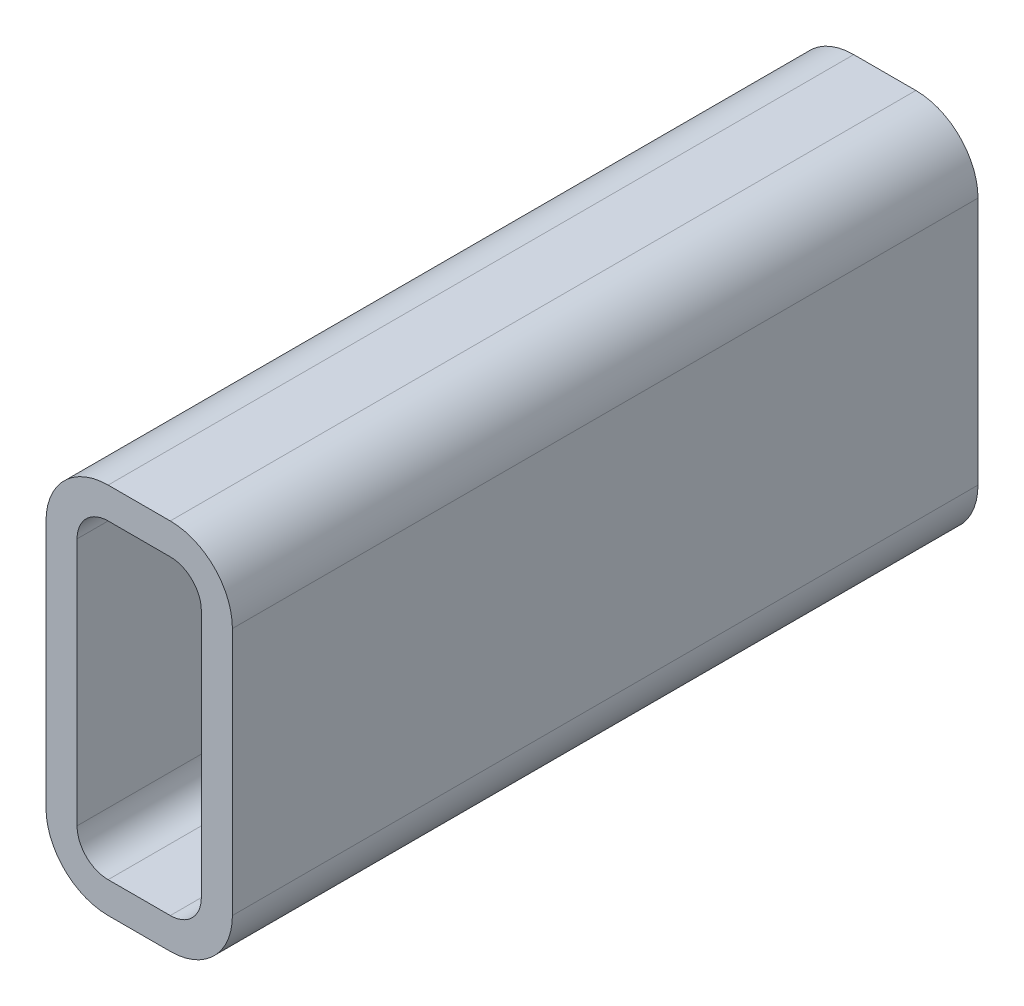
ISO-10303-21;
HEADER;
FILE_DESCRIPTION(('STEP AP214'),'2;1');
FILE_NAME('part.step','',(''),(''),'','','');
FILE_SCHEMA(('AUTOMOTIVE_DESIGN { 1 0 10303 214 1 1 1 1 }'));
ENDSEC;
DATA;
#1=APPLICATION_CONTEXT('core data for automotive mechanical design processes');
#2=APPLICATION_PROTOCOL_DEFINITION('international standard','automotive_design',2000,#1);
#3=PRODUCT_CONTEXT('',#1,'mechanical');
#4=PRODUCT('Part','Part','',(#3));
#5=PRODUCT_RELATED_PRODUCT_CATEGORY('part','',(#4));
#6=PRODUCT_DEFINITION_FORMATION('','',#4);
#7=PRODUCT_DEFINITION_CONTEXT('part definition',#1,'design');
#8=PRODUCT_DEFINITION('design','',#6,#7);
#9=PRODUCT_DEFINITION_SHAPE('','',#8);
#10=(LENGTH_UNIT() NAMED_UNIT(*) SI_UNIT(.MILLI.,.METRE.));
#11=(NAMED_UNIT(*) PLANE_ANGLE_UNIT() SI_UNIT($,.RADIAN.));
#12=(NAMED_UNIT(*) SI_UNIT($,.STERADIAN.) SOLID_ANGLE_UNIT());
#13=UNCERTAINTY_MEASURE_WITH_UNIT(LENGTH_MEASURE(1.E-05),#10,'distance_accuracy_value','');
#14=(GEOMETRIC_REPRESENTATION_CONTEXT(3) GLOBAL_UNCERTAINTY_ASSIGNED_CONTEXT((#13)) GLOBAL_UNIT_ASSIGNED_CONTEXT((#10,
#11,#12)) REPRESENTATION_CONTEXT('',''));
#15=CARTESIAN_POINT('',(0.,0.,0.));
#16=DIRECTION('',(0.,0.,1.));
#17=DIRECTION('',(1.,0.,0.));
#18=AXIS2_PLACEMENT_3D('',#15,#16,#17);
#19=CARTESIAN_POINT('',(27.8891160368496,129.011948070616,304.8));
#20=DIRECTION('',(0.,0.,1.));
#21=DIRECTION('',(1.,0.,0.));
#22=AXIS2_PLACEMENT_3D('',#19,#20,#21);
#23=PLANE('',#22);
#24=CARTESIAN_POINT('',(27.8891160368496,129.011948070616,304.8));
#25=DIRECTION('',(0.,0.,1.));
#26=DIRECTION('',(1.,0.,0.));
#27=AXIS2_PLACEMENT_3D('',#24,#25,#26);
#28=CIRCLE('',#27,25.4);
#29=CARTESIAN_POINT('',(27.8891160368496,154.411948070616,304.8));
#30=VERTEX_POINT('',#29);
#31=CARTESIAN_POINT('',(2.48911603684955,129.011948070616,304.8));
#32=VERTEX_POINT('',#31);
#33=EDGE_CURVE('E211',#30,#32,#28,.T.);
#34=ORIENTED_EDGE('',*,*,#33,.T.);
#35=DIRECTION('',(0.,-1.,0.));
#36=VECTOR('',#35,1.);
#37=CARTESIAN_POINT('',(2.48911603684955,27.4119480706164,304.8));
#38=LINE('',#37,#36);
#39=CARTESIAN_POINT('',(2.48911603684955,27.4119480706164,304.8));
#40=VERTEX_POINT('',#39);
#41=EDGE_CURVE('E214',#32,#40,#38,.T.);
#42=ORIENTED_EDGE('',*,*,#41,.T.);
#43=CARTESIAN_POINT('',(27.8891160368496,27.4119480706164,304.8));
#44=DIRECTION('',(0.,0.,1.));
#45=DIRECTION('',(1.,0.,0.));
#46=AXIS2_PLACEMENT_3D('',#43,#44,#45);
#47=CIRCLE('',#46,25.4);
#48=CARTESIAN_POINT('',(27.8891160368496,2.01194807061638,304.8));
#49=VERTEX_POINT('',#48);
#50=EDGE_CURVE('E217',#40,#49,#47,.T.);
#51=ORIENTED_EDGE('',*,*,#50,.T.);
#52=DIRECTION('',(1.,0.,0.));
#53=VECTOR('',#52,1.);
#54=CARTESIAN_POINT('',(53.2891160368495,2.01194807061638,304.8));
#55=LINE('',#54,#53);
#56=CARTESIAN_POINT('',(53.2891160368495,2.01194807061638,304.8));
#57=VERTEX_POINT('',#56);
#58=EDGE_CURVE('E219',#49,#57,#55,.T.);
#59=ORIENTED_EDGE('',*,*,#58,.T.);
#60=CARTESIAN_POINT('',(53.2891160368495,27.4119480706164,304.8));
#61=DIRECTION('',(0.,0.,1.));
#62=DIRECTION('',(1.,0.,0.));
#63=AXIS2_PLACEMENT_3D('',#60,#61,#62);
#64=CIRCLE('',#63,25.4);
#65=CARTESIAN_POINT('',(78.6891160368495,27.4119480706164,304.8));
#66=VERTEX_POINT('',#65);
#67=EDGE_CURVE('E221',#57,#66,#64,.T.);
#68=ORIENTED_EDGE('',*,*,#67,.T.);
#69=DIRECTION('',(0.,1.,0.));
#70=VECTOR('',#69,1.);
#71=CARTESIAN_POINT('',(78.6891160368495,129.011948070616,304.8));
#72=LINE('',#71,#70);
#73=CARTESIAN_POINT('',(78.6891160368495,129.011948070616,304.8));
#74=VERTEX_POINT('',#73);
#75=EDGE_CURVE('E223',#66,#74,#72,.T.);
#76=ORIENTED_EDGE('',*,*,#75,.T.);
#77=CARTESIAN_POINT('',(53.2891160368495,129.011948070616,304.8));
#78=DIRECTION('',(0.,0.,1.));
#79=DIRECTION('',(1.,0.,0.));
#80=AXIS2_PLACEMENT_3D('',#77,#78,#79);
#81=CIRCLE('',#80,25.4);
#82=CARTESIAN_POINT('',(53.2891160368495,154.411948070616,304.8));
#83=VERTEX_POINT('',#82);
#84=EDGE_CURVE('E225',#74,#83,#81,.T.);
#85=ORIENTED_EDGE('',*,*,#84,.T.);
#86=DIRECTION('',(-1.,0.,0.));
#87=VECTOR('',#86,1.);
#88=CARTESIAN_POINT('',(27.8891160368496,154.411948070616,304.8));
#89=LINE('',#88,#87);
#90=EDGE_CURVE('E227',#83,#30,#89,.T.);
#91=ORIENTED_EDGE('',*,*,#90,.T.);
#92=EDGE_LOOP('',(#34,#42,#51,#59,#68,#76,#85,#91));
#93=FACE_BOUND('',#92,.T.);
#94=DIRECTION('',(0.,-1.,0.));
#95=VECTOR('',#94,1.);
#96=CARTESIAN_POINT('',(15.1891160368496,27.4119480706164,304.8));
#97=LINE('',#96,#95);
#98=CARTESIAN_POINT('',(15.1891160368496,129.011948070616,304.8));
#99=VERTEX_POINT('',#98);
#100=CARTESIAN_POINT('',(15.1891160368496,27.4119480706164,304.8));
#101=VERTEX_POINT('',#100);
#102=EDGE_CURVE('E154',#99,#101,#97,.T.);
#103=ORIENTED_EDGE('',*,*,#102,.F.);
#104=CARTESIAN_POINT('',(27.8891160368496,129.011948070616,304.8));
#105=DIRECTION('',(0.,0.,1.));
#106=DIRECTION('',(1.,0.,0.));
#107=AXIS2_PLACEMENT_3D('',#104,#105,#106);
#108=CIRCLE('',#107,12.7);
#109=CARTESIAN_POINT('',(27.8891160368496,141.711948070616,304.8));
#110=VERTEX_POINT('',#109);
#111=EDGE_CURVE('E146',#110,#99,#108,.T.);
#112=ORIENTED_EDGE('',*,*,#111,.F.);
#113=DIRECTION('',(-1.,0.,0.));
#114=VECTOR('',#113,1.);
#115=CARTESIAN_POINT('',(27.8891160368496,141.711948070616,304.8));
#116=LINE('',#115,#114);
#117=CARTESIAN_POINT('',(53.2891160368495,141.711948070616,304.8));
#118=VERTEX_POINT('',#117);
#119=EDGE_CURVE('E179',#118,#110,#116,.T.);
#120=ORIENTED_EDGE('',*,*,#119,.F.);
#121=CARTESIAN_POINT('',(53.2891160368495,129.011948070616,304.8));
#122=DIRECTION('',(0.,0.,1.));
#123=DIRECTION('',(1.,0.,0.));
#124=AXIS2_PLACEMENT_3D('',#121,#122,#123);
#125=CIRCLE('',#124,12.7);
#126=CARTESIAN_POINT('',(65.9891160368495,129.011948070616,304.8));
#127=VERTEX_POINT('',#126);
#128=EDGE_CURVE('E177',#127,#118,#125,.T.);
#129=ORIENTED_EDGE('',*,*,#128,.F.);
#130=DIRECTION('',(0.,1.,0.));
#131=VECTOR('',#130,1.);
#132=CARTESIAN_POINT('',(65.9891160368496,129.011948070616,304.8));
#133=LINE('',#132,#131);
#134=CARTESIAN_POINT('',(65.9891160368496,27.4119480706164,304.8));
#135=VERTEX_POINT('',#134);
#136=EDGE_CURVE('E175',#135,#127,#133,.T.);
#137=ORIENTED_EDGE('',*,*,#136,.F.);
#138=CARTESIAN_POINT('',(53.2891160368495,27.4119480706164,304.8));
#139=DIRECTION('',(0.,0.,1.));
#140=DIRECTION('',(1.,0.,0.));
#141=AXIS2_PLACEMENT_3D('',#138,#139,#140);
#142=CIRCLE('',#141,12.7);
#143=CARTESIAN_POINT('',(53.2891160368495,14.7119480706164,304.8));
#144=VERTEX_POINT('',#143);
#145=EDGE_CURVE('E173',#144,#135,#142,.T.);
#146=ORIENTED_EDGE('',*,*,#145,.F.);
#147=DIRECTION('',(1.,0.,0.));
#148=VECTOR('',#147,1.);
#149=CARTESIAN_POINT('',(53.2891160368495,14.7119480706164,304.8));
#150=LINE('',#149,#148);
#151=CARTESIAN_POINT('',(27.8891160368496,14.7119480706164,304.8));
#152=VERTEX_POINT('',#151);
#153=EDGE_CURVE('E169',#152,#144,#150,.T.);
#154=ORIENTED_EDGE('',*,*,#153,.F.);
#155=CARTESIAN_POINT('',(27.8891160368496,27.4119480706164,304.8));
#156=DIRECTION('',(0.,0.,1.));
#157=DIRECTION('',(1.,0.,0.));
#158=AXIS2_PLACEMENT_3D('',#155,#156,#157);
#159=CIRCLE('',#158,12.7);
#160=EDGE_CURVE('E167',#101,#152,#159,.T.);
#161=ORIENTED_EDGE('',*,*,#160,.F.);
#162=EDGE_LOOP('',(#103,#112,#120,#129,#137,#146,#154,#161));
#163=FACE_BOUND('',#162,.T.);
#164=ADVANCED_FACE('F33',(#93,#163),#23,.T.);
#165=CARTESIAN_POINT('',(27.8891160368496,129.011948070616,0.));
#166=DIRECTION('',(0.,0.,1.));
#167=DIRECTION('',(1.,0.,0.));
#168=AXIS2_PLACEMENT_3D('',#165,#166,#167);
#169=PLANE('',#168);
#170=CARTESIAN_POINT('',(27.8891160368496,129.011948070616,0.));
#171=DIRECTION('',(0.,0.,1.));
#172=DIRECTION('',(1.,0.,0.));
#173=AXIS2_PLACEMENT_3D('',#170,#171,#172);
#174=CIRCLE('',#173,25.4);
#175=CARTESIAN_POINT('',(27.8891160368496,154.411948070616,0.));
#176=VERTEX_POINT('',#175);
#177=CARTESIAN_POINT('',(2.48911603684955,129.011948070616,0.));
#178=VERTEX_POINT('',#177);
#179=EDGE_CURVE('E162',#176,#178,#174,.T.);
#180=ORIENTED_EDGE('',*,*,#179,.F.);
#181=DIRECTION('',(-1.,0.,0.));
#182=VECTOR('',#181,1.);
#183=CARTESIAN_POINT('',(27.8891160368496,154.411948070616,0.));
#184=LINE('',#183,#182);
#185=CARTESIAN_POINT('',(53.2891160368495,154.411948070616,0.));
#186=VERTEX_POINT('',#185);
#187=EDGE_CURVE('E215',#186,#176,#184,.T.);
#188=ORIENTED_EDGE('',*,*,#187,.F.);
#189=CARTESIAN_POINT('',(53.2891160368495,129.011948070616,0.));
#190=DIRECTION('',(0.,0.,1.));
#191=DIRECTION('',(1.,0.,0.));
#192=AXIS2_PLACEMENT_3D('',#189,#190,#191);
#193=CIRCLE('',#192,25.4);
#194=CARTESIAN_POINT('',(78.6891160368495,129.011948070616,0.));
#195=VERTEX_POINT('',#194);
#196=EDGE_CURVE('E242',#195,#186,#193,.T.);
#197=ORIENTED_EDGE('',*,*,#196,.F.);
#198=DIRECTION('',(0.,1.,0.));
#199=VECTOR('',#198,1.);
#200=CARTESIAN_POINT('',(78.6891160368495,129.011948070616,0.));
#201=LINE('',#200,#199);
#202=CARTESIAN_POINT('',(78.6891160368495,27.4119480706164,0.));
#203=VERTEX_POINT('',#202);
#204=EDGE_CURVE('E240',#203,#195,#201,.T.);
#205=ORIENTED_EDGE('',*,*,#204,.F.);
#206=CARTESIAN_POINT('',(53.2891160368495,27.4119480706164,0.));
#207=DIRECTION('',(0.,0.,1.));
#208=DIRECTION('',(1.,0.,0.));
#209=AXIS2_PLACEMENT_3D('',#206,#207,#208);
#210=CIRCLE('',#209,25.4);
#211=CARTESIAN_POINT('',(53.2891160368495,2.01194807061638,0.));
#212=VERTEX_POINT('',#211);
#213=EDGE_CURVE('E238',#212,#203,#210,.T.);
#214=ORIENTED_EDGE('',*,*,#213,.F.);
#215=DIRECTION('',(1.,0.,0.));
#216=VECTOR('',#215,1.);
#217=CARTESIAN_POINT('',(53.2891160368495,2.01194807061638,0.));
#218=LINE('',#217,#216);
#219=CARTESIAN_POINT('',(27.8891160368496,2.01194807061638,0.));
#220=VERTEX_POINT('',#219);
#221=EDGE_CURVE('E236',#220,#212,#218,.T.);
#222=ORIENTED_EDGE('',*,*,#221,.F.);
#223=CARTESIAN_POINT('',(27.8891160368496,27.4119480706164,0.));
#224=DIRECTION('',(0.,0.,1.));
#225=DIRECTION('',(1.,0.,0.));
#226=AXIS2_PLACEMENT_3D('',#223,#224,#225);
#227=CIRCLE('',#226,25.4);
#228=CARTESIAN_POINT('',(2.48911603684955,27.4119480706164,0.));
#229=VERTEX_POINT('',#228);
#230=EDGE_CURVE('E234',#229,#220,#227,.T.);
#231=ORIENTED_EDGE('',*,*,#230,.F.);
#232=DIRECTION('',(0.,-1.,0.));
#233=VECTOR('',#232,1.);
#234=CARTESIAN_POINT('',(2.48911603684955,27.4119480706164,0.));
#235=LINE('',#234,#233);
#236=EDGE_CURVE('E232',#178,#229,#235,.T.);
#237=ORIENTED_EDGE('',*,*,#236,.F.);
#238=EDGE_LOOP('',(#180,#188,#197,#205,#214,#222,#231,#237));
#239=FACE_BOUND('',#238,.T.);
#240=CARTESIAN_POINT('',(27.8891160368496,129.011948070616,0.));
#241=DIRECTION('',(0.,0.,1.));
#242=DIRECTION('',(1.,0.,0.));
#243=AXIS2_PLACEMENT_3D('',#240,#241,#242);
#244=CIRCLE('',#243,12.7);
#245=CARTESIAN_POINT('',(27.8891160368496,141.711948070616,0.));
#246=VERTEX_POINT('',#245);
#247=CARTESIAN_POINT('',(15.1891160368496,129.011948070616,0.));
#248=VERTEX_POINT('',#247);
#249=EDGE_CURVE('E56',#246,#248,#244,.T.);
#250=ORIENTED_EDGE('',*,*,#249,.T.);
#251=DIRECTION('',(0.,-1.,0.));
#252=VECTOR('',#251,1.);
#253=CARTESIAN_POINT('',(15.1891160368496,27.4119480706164,0.));
#254=LINE('',#253,#252);
#255=CARTESIAN_POINT('',(15.1891160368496,27.4119480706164,0.));
#256=VERTEX_POINT('',#255);
#257=EDGE_CURVE('E161',#248,#256,#254,.T.);
#258=ORIENTED_EDGE('',*,*,#257,.T.);
#259=CARTESIAN_POINT('',(27.8891160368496,27.4119480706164,0.));
#260=DIRECTION('',(0.,0.,1.));
#261=DIRECTION('',(1.,0.,0.));
#262=AXIS2_PLACEMENT_3D('',#259,#260,#261);
#263=CIRCLE('',#262,12.7);
#264=CARTESIAN_POINT('',(27.8891160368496,14.7119480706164,0.));
#265=VERTEX_POINT('',#264);
#266=EDGE_CURVE('E183',#256,#265,#263,.T.);
#267=ORIENTED_EDGE('',*,*,#266,.T.);
#268=DIRECTION('',(1.,0.,0.));
#269=VECTOR('',#268,1.);
#270=CARTESIAN_POINT('',(53.2891160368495,14.7119480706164,0.));
#271=LINE('',#270,#269);
#272=CARTESIAN_POINT('',(53.2891160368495,14.7119480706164,0.));
#273=VERTEX_POINT('',#272);
#274=EDGE_CURVE('E186',#265,#273,#271,.T.);
#275=ORIENTED_EDGE('',*,*,#274,.T.);
#276=CARTESIAN_POINT('',(53.2891160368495,27.4119480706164,0.));
#277=DIRECTION('',(0.,0.,1.));
#278=DIRECTION('',(1.,0.,0.));
#279=AXIS2_PLACEMENT_3D('',#276,#277,#278);
#280=CIRCLE('',#279,12.7);
#281=CARTESIAN_POINT('',(65.9891160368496,27.4119480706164,0.));
#282=VERTEX_POINT('',#281);
#283=EDGE_CURVE('E189',#273,#282,#280,.T.);
#284=ORIENTED_EDGE('',*,*,#283,.T.);
#285=DIRECTION('',(0.,1.,0.));
#286=VECTOR('',#285,1.);
#287=CARTESIAN_POINT('',(65.9891160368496,129.011948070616,0.));
#288=LINE('',#287,#286);
#289=CARTESIAN_POINT('',(65.9891160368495,129.011948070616,0.));
#290=VERTEX_POINT('',#289);
#291=EDGE_CURVE('E192',#282,#290,#288,.T.);
#292=ORIENTED_EDGE('',*,*,#291,.T.);
#293=CARTESIAN_POINT('',(53.2891160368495,129.011948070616,0.));
#294=DIRECTION('',(0.,0.,1.));
#295=DIRECTION('',(1.,0.,0.));
#296=AXIS2_PLACEMENT_3D('',#293,#294,#295);
#297=CIRCLE('',#296,12.7);
#298=CARTESIAN_POINT('',(53.2891160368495,141.711948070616,0.));
#299=VERTEX_POINT('',#298);
#300=EDGE_CURVE('E195',#290,#299,#297,.T.);
#301=ORIENTED_EDGE('',*,*,#300,.T.);
#302=DIRECTION('',(-1.,0.,0.));
#303=VECTOR('',#302,1.);
#304=CARTESIAN_POINT('',(27.8891160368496,141.711948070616,0.));
#305=LINE('',#304,#303);
#306=EDGE_CURVE('E155',#299,#246,#305,.T.);
#307=ORIENTED_EDGE('',*,*,#306,.T.);
#308=EDGE_LOOP('',(#250,#258,#267,#275,#284,#292,#301,#307));
#309=FACE_BOUND('',#308,.T.);
#310=ADVANCED_FACE('F272',(#239,#309),#169,.F.);
#311=CARTESIAN_POINT('',(27.8891160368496,129.011948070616,304.8));
#312=DIRECTION('',(0.,0.,-1.));
#313=DIRECTION('',(-1.,0.,0.));
#314=AXIS2_PLACEMENT_3D('',#311,#312,#313);
#315=CYLINDRICAL_SURFACE('',#314,25.4);
#316=ORIENTED_EDGE('',*,*,#179,.T.);
#317=DIRECTION('',(0.,0.,-1.));
#318=VECTOR('',#317,1.);
#319=CARTESIAN_POINT('',(2.48911603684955,129.011948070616,304.8));
#320=LINE('',#319,#318);
#321=EDGE_CURVE('E11',#32,#178,#320,.T.);
#322=ORIENTED_EDGE('',*,*,#321,.F.);
#323=ORIENTED_EDGE('',*,*,#33,.F.);
#324=DIRECTION('',(0.,0.,-1.));
#325=VECTOR('',#324,1.);
#326=CARTESIAN_POINT('',(27.8891160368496,154.411948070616,304.8));
#327=LINE('',#326,#325);
#328=EDGE_CURVE('E229',#30,#176,#327,.T.);
#329=ORIENTED_EDGE('',*,*,#328,.T.);
#330=EDGE_LOOP('',(#316,#322,#323,#329));
#331=FACE_BOUND('',#330,.T.);
#332=ADVANCED_FACE('F35',(#331),#315,.T.);
#333=CARTESIAN_POINT('',(2.48911603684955,27.4119480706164,304.8));
#334=DIRECTION('',(1.,0.,0.));
#335=DIRECTION('',(0.,0.,-1.));
#336=AXIS2_PLACEMENT_3D('',#333,#334,#335);
#337=PLANE('',#336);
#338=ORIENTED_EDGE('',*,*,#236,.T.);
#339=DIRECTION('',(0.,0.,-1.));
#340=VECTOR('',#339,1.);
#341=CARTESIAN_POINT('',(2.48911603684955,27.4119480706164,304.8));
#342=LINE('',#341,#340);
#343=EDGE_CURVE('E41',#40,#229,#342,.T.);
#344=ORIENTED_EDGE('',*,*,#343,.F.);
#345=ORIENTED_EDGE('',*,*,#41,.F.);
#346=ORIENTED_EDGE('',*,*,#321,.T.);
#347=EDGE_LOOP('',(#338,#344,#345,#346));
#348=FACE_BOUND('',#347,.T.);
#349=ADVANCED_FACE('F289',(#348),#337,.F.);
#350=CARTESIAN_POINT('',(27.8891160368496,27.4119480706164,304.8));
#351=DIRECTION('',(0.,0.,-1.));
#352=DIRECTION('',(-1.,0.,0.));
#353=AXIS2_PLACEMENT_3D('',#350,#351,#352);
#354=CYLINDRICAL_SURFACE('',#353,25.4);
#355=ORIENTED_EDGE('',*,*,#230,.T.);
#356=DIRECTION('',(0.,0.,-1.));
#357=VECTOR('',#356,1.);
#358=CARTESIAN_POINT('',(27.8891160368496,2.01194807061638,304.8));
#359=LINE('',#358,#357);
#360=EDGE_CURVE('E259',#49,#220,#359,.T.);
#361=ORIENTED_EDGE('',*,*,#360,.F.);
#362=ORIENTED_EDGE('',*,*,#50,.F.);
#363=ORIENTED_EDGE('',*,*,#343,.T.);
#364=EDGE_LOOP('',(#355,#361,#362,#363));
#365=FACE_BOUND('',#364,.T.);
#366=ADVANCED_FACE('F266',(#365),#354,.T.);
#367=CARTESIAN_POINT('',(53.2891160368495,2.01194807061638,304.8));
#368=DIRECTION('',(0.,1.,0.));
#369=DIRECTION('',(0.,0.,1.));
#370=AXIS2_PLACEMENT_3D('',#367,#368,#369);
#371=PLANE('',#370);
#372=ORIENTED_EDGE('',*,*,#221,.T.);
#373=DIRECTION('',(0.,0.,-1.));
#374=VECTOR('',#373,1.);
#375=CARTESIAN_POINT('',(53.2891160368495,2.01194807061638,304.8));
#376=LINE('',#375,#374);
#377=EDGE_CURVE('E256',#57,#212,#376,.T.);
#378=ORIENTED_EDGE('',*,*,#377,.F.);
#379=ORIENTED_EDGE('',*,*,#58,.F.);
#380=ORIENTED_EDGE('',*,*,#360,.T.);
#381=EDGE_LOOP('',(#372,#378,#379,#380));
#382=FACE_BOUND('',#381,.T.);
#383=ADVANCED_FACE('F278',(#382),#371,.F.);
#384=CARTESIAN_POINT('',(53.2891160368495,27.4119480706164,304.8));
#385=DIRECTION('',(0.,0.,-1.));
#386=DIRECTION('',(-1.,0.,0.));
#387=AXIS2_PLACEMENT_3D('',#384,#385,#386);
#388=CYLINDRICAL_SURFACE('',#387,25.4);
#389=ORIENTED_EDGE('',*,*,#213,.T.);
#390=DIRECTION('',(0.,0.,-1.));
#391=VECTOR('',#390,1.);
#392=CARTESIAN_POINT('',(78.6891160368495,27.4119480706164,304.8));
#393=LINE('',#392,#391);
#394=EDGE_CURVE('E253',#66,#203,#393,.T.);
#395=ORIENTED_EDGE('',*,*,#394,.F.);
#396=ORIENTED_EDGE('',*,*,#67,.F.);
#397=ORIENTED_EDGE('',*,*,#377,.T.);
#398=EDGE_LOOP('',(#389,#395,#396,#397));
#399=FACE_BOUND('',#398,.T.);
#400=ADVANCED_FACE('F282',(#399),#388,.T.);
#401=CARTESIAN_POINT('',(78.6891160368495,129.011948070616,304.8));
#402=DIRECTION('',(-1.,0.,0.));
#403=DIRECTION('',(0.,0.,1.));
#404=AXIS2_PLACEMENT_3D('',#401,#402,#403);
#405=PLANE('',#404);
#406=ORIENTED_EDGE('',*,*,#204,.T.);
#407=DIRECTION('',(0.,0.,-1.));
#408=VECTOR('',#407,1.);
#409=CARTESIAN_POINT('',(78.6891160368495,129.011948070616,304.8));
#410=LINE('',#409,#408);
#411=EDGE_CURVE('E250',#74,#195,#410,.T.);
#412=ORIENTED_EDGE('',*,*,#411,.F.);
#413=ORIENTED_EDGE('',*,*,#75,.F.);
#414=ORIENTED_EDGE('',*,*,#394,.T.);
#415=EDGE_LOOP('',(#406,#412,#413,#414));
#416=FACE_BOUND('',#415,.T.);
#417=ADVANCED_FACE('F302',(#416),#405,.F.);
#418=CARTESIAN_POINT('',(53.2891160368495,129.011948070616,304.8));
#419=DIRECTION('',(0.,0.,-1.));
#420=DIRECTION('',(-1.,0.,0.));
#421=AXIS2_PLACEMENT_3D('',#418,#419,#420);
#422=CYLINDRICAL_SURFACE('',#421,25.4);
#423=ORIENTED_EDGE('',*,*,#196,.T.);
#424=DIRECTION('',(0.,0.,-1.));
#425=VECTOR('',#424,1.);
#426=CARTESIAN_POINT('',(53.2891160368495,154.411948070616,304.8));
#427=LINE('',#426,#425);
#428=EDGE_CURVE('E247',#83,#186,#427,.T.);
#429=ORIENTED_EDGE('',*,*,#428,.F.);
#430=ORIENTED_EDGE('',*,*,#84,.F.);
#431=ORIENTED_EDGE('',*,*,#411,.T.);
#432=EDGE_LOOP('',(#423,#429,#430,#431));
#433=FACE_BOUND('',#432,.T.);
#434=ADVANCED_FACE('F300',(#433),#422,.T.);
#435=CARTESIAN_POINT('',(27.8891160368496,154.411948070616,304.8));
#436=DIRECTION('',(0.,-1.,0.));
#437=DIRECTION('',(0.,0.,-1.));
#438=AXIS2_PLACEMENT_3D('',#435,#436,#437);
#439=PLANE('',#438);
#440=ORIENTED_EDGE('',*,*,#187,.T.);
#441=ORIENTED_EDGE('',*,*,#328,.F.);
#442=ORIENTED_EDGE('',*,*,#90,.F.);
#443=ORIENTED_EDGE('',*,*,#428,.T.);
#444=EDGE_LOOP('',(#440,#441,#442,#443));
#445=FACE_BOUND('',#444,.T.);
#446=ADVANCED_FACE('F295',(#445),#439,.F.);
#447=CARTESIAN_POINT('',(27.8891160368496,129.011948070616,304.8));
#448=DIRECTION('',(0.,0.,-1.));
#449=DIRECTION('',(-1.,0.,0.));
#450=AXIS2_PLACEMENT_3D('',#447,#448,#449);
#451=CYLINDRICAL_SURFACE('',#450,12.7);
#452=ORIENTED_EDGE('',*,*,#249,.F.);
#453=DIRECTION('',(0.,0.,-1.));
#454=VECTOR('',#453,1.);
#455=CARTESIAN_POINT('',(27.8891160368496,141.711948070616,304.8));
#456=LINE('',#455,#454);
#457=EDGE_CURVE('E150',#110,#246,#456,.T.);
#458=ORIENTED_EDGE('',*,*,#457,.F.);
#459=ORIENTED_EDGE('',*,*,#111,.T.);
#460=DIRECTION('',(0.,0.,-1.));
#461=VECTOR('',#460,1.);
#462=CARTESIAN_POINT('',(15.1891160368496,129.011948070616,304.8));
#463=LINE('',#462,#461);
#464=EDGE_CURVE('E149',#99,#248,#463,.T.);
#465=ORIENTED_EDGE('',*,*,#464,.T.);
#466=EDGE_LOOP('',(#452,#458,#459,#465));
#467=FACE_BOUND('',#466,.T.);
#468=ADVANCED_FACE('F148',(#467),#451,.F.);
#469=CARTESIAN_POINT('',(15.1891160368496,27.4119480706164,304.8));
#470=DIRECTION('',(1.,0.,0.));
#471=DIRECTION('',(0.,0.,-1.));
#472=AXIS2_PLACEMENT_3D('',#469,#470,#471);
#473=PLANE('',#472);
#474=ORIENTED_EDGE('',*,*,#257,.F.);
#475=ORIENTED_EDGE('',*,*,#464,.F.);
#476=ORIENTED_EDGE('',*,*,#102,.T.);
#477=DIRECTION('',(0.,0.,-1.));
#478=VECTOR('',#477,1.);
#479=CARTESIAN_POINT('',(15.1891160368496,27.4119480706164,304.8));
#480=LINE('',#479,#478);
#481=EDGE_CURVE('E163',#101,#256,#480,.T.);
#482=ORIENTED_EDGE('',*,*,#481,.T.);
#483=EDGE_LOOP('',(#474,#475,#476,#482));
#484=FACE_BOUND('',#483,.T.);
#485=ADVANCED_FACE('F158',(#484),#473,.T.);
#486=CARTESIAN_POINT('',(27.8891160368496,27.4119480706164,304.8));
#487=DIRECTION('',(0.,0.,-1.));
#488=DIRECTION('',(-1.,0.,0.));
#489=AXIS2_PLACEMENT_3D('',#486,#487,#488);
#490=CYLINDRICAL_SURFACE('',#489,12.7);
#491=ORIENTED_EDGE('',*,*,#266,.F.);
#492=ORIENTED_EDGE('',*,*,#481,.F.);
#493=ORIENTED_EDGE('',*,*,#160,.T.);
#494=DIRECTION('',(0.,0.,-1.));
#495=VECTOR('',#494,1.);
#496=CARTESIAN_POINT('',(27.8891160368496,14.7119480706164,304.8));
#497=LINE('',#496,#495);
#498=EDGE_CURVE('E208',#152,#265,#497,.T.);
#499=ORIENTED_EDGE('',*,*,#498,.T.);
#500=EDGE_LOOP('',(#491,#492,#493,#499));
#501=FACE_BOUND('',#500,.T.);
#502=ADVANCED_FACE('F327',(#501),#490,.F.);
#503=CARTESIAN_POINT('',(53.2891160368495,14.7119480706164,304.8));
#504=DIRECTION('',(0.,1.,0.));
#505=DIRECTION('',(0.,0.,1.));
#506=AXIS2_PLACEMENT_3D('',#503,#504,#505);
#507=PLANE('',#506);
#508=ORIENTED_EDGE('',*,*,#274,.F.);
#509=ORIENTED_EDGE('',*,*,#498,.F.);
#510=ORIENTED_EDGE('',*,*,#153,.T.);
#511=DIRECTION('',(0.,0.,-1.));
#512=VECTOR('',#511,1.);
#513=CARTESIAN_POINT('',(53.2891160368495,14.7119480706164,304.8));
#514=LINE('',#513,#512);
#515=EDGE_CURVE('E206',#144,#273,#514,.T.);
#516=ORIENTED_EDGE('',*,*,#515,.T.);
#517=EDGE_LOOP('',(#508,#509,#510,#516));
#518=FACE_BOUND('',#517,.T.);
#519=ADVANCED_FACE('F331',(#518),#507,.T.);
#520=CARTESIAN_POINT('',(53.2891160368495,27.4119480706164,304.8));
#521=DIRECTION('',(0.,0.,-1.));
#522=DIRECTION('',(-1.,0.,0.));
#523=AXIS2_PLACEMENT_3D('',#520,#521,#522);
#524=CYLINDRICAL_SURFACE('',#523,12.7);
#525=ORIENTED_EDGE('',*,*,#283,.F.);
#526=ORIENTED_EDGE('',*,*,#515,.F.);
#527=ORIENTED_EDGE('',*,*,#145,.T.);
#528=DIRECTION('',(0.,0.,-1.));
#529=VECTOR('',#528,1.);
#530=CARTESIAN_POINT('',(65.9891160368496,27.4119480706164,304.8));
#531=LINE('',#530,#529);
#532=EDGE_CURVE('E204',#135,#282,#531,.T.);
#533=ORIENTED_EDGE('',*,*,#532,.T.);
#534=EDGE_LOOP('',(#525,#526,#527,#533));
#535=FACE_BOUND('',#534,.T.);
#536=ADVANCED_FACE('F337',(#535),#524,.F.);
#537=CARTESIAN_POINT('',(65.9891160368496,129.011948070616,304.8));
#538=DIRECTION('',(-1.,0.,0.));
#539=DIRECTION('',(0.,0.,1.));
#540=AXIS2_PLACEMENT_3D('',#537,#538,#539);
#541=PLANE('',#540);
#542=ORIENTED_EDGE('',*,*,#291,.F.);
#543=ORIENTED_EDGE('',*,*,#532,.F.);
#544=ORIENTED_EDGE('',*,*,#136,.T.);
#545=DIRECTION('',(0.,0.,-1.));
#546=VECTOR('',#545,1.);
#547=CARTESIAN_POINT('',(65.9891160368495,129.011948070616,304.8));
#548=LINE('',#547,#546);
#549=EDGE_CURVE('E202',#127,#290,#548,.T.);
#550=ORIENTED_EDGE('',*,*,#549,.T.);
#551=EDGE_LOOP('',(#542,#543,#544,#550));
#552=FACE_BOUND('',#551,.T.);
#553=ADVANCED_FACE('F341',(#552),#541,.T.);
#554=CARTESIAN_POINT('',(53.2891160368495,129.011948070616,304.8));
#555=DIRECTION('',(0.,0.,-1.));
#556=DIRECTION('',(-1.,0.,0.));
#557=AXIS2_PLACEMENT_3D('',#554,#555,#556);
#558=CYLINDRICAL_SURFACE('',#557,12.7);
#559=ORIENTED_EDGE('',*,*,#300,.F.);
#560=ORIENTED_EDGE('',*,*,#549,.F.);
#561=ORIENTED_EDGE('',*,*,#128,.T.);
#562=DIRECTION('',(0.,0.,-1.));
#563=VECTOR('',#562,1.);
#564=CARTESIAN_POINT('',(53.2891160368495,141.711948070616,304.8));
#565=LINE('',#564,#563);
#566=EDGE_CURVE('E48',#118,#299,#565,.T.);
#567=ORIENTED_EDGE('',*,*,#566,.T.);
#568=EDGE_LOOP('',(#559,#560,#561,#567));
#569=FACE_BOUND('',#568,.T.);
#570=ADVANCED_FACE('F345',(#569),#558,.F.);
#571=CARTESIAN_POINT('',(27.8891160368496,141.711948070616,304.8));
#572=DIRECTION('',(0.,-1.,0.));
#573=DIRECTION('',(0.,0.,-1.));
#574=AXIS2_PLACEMENT_3D('',#571,#572,#573);
#575=PLANE('',#574);
#576=ORIENTED_EDGE('',*,*,#306,.F.);
#577=ORIENTED_EDGE('',*,*,#566,.F.);
#578=ORIENTED_EDGE('',*,*,#119,.T.);
#579=ORIENTED_EDGE('',*,*,#457,.T.);
#580=EDGE_LOOP('',(#576,#577,#578,#579));
#581=FACE_BOUND('',#580,.T.);
#582=ADVANCED_FACE('F349',(#581),#575,.T.);
#583=CLOSED_SHELL('',(#164,#310,#332,#349,#366,#383,#400,#417,#434,#446,#468,#485,#502,#519,
#536,#553,#570,#582));
#584=MANIFOLD_SOLID_BREP('B2',#583);
#585=ADVANCED_BREP_SHAPE_REPRESENTATION('',(#18,#584),#14);
#586=SHAPE_DEFINITION_REPRESENTATION(#9,#585);
ENDSEC;
END-ISO-10303-21;
